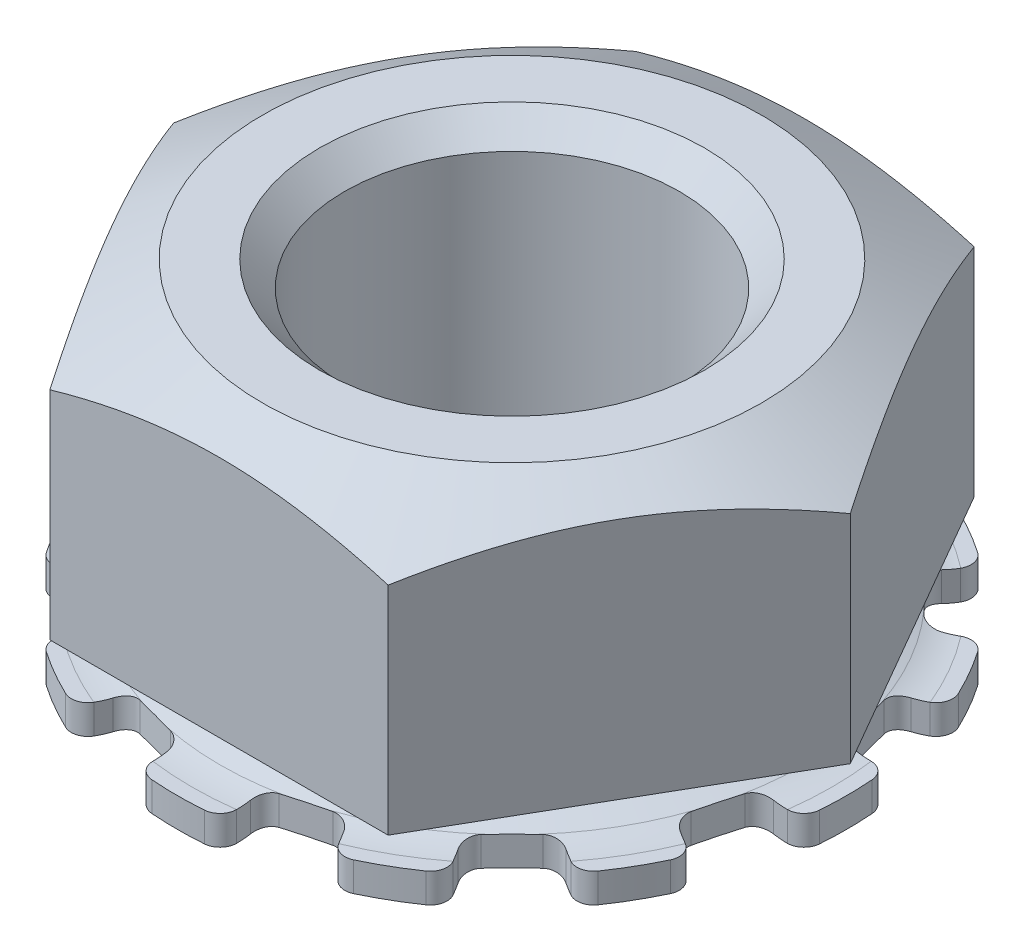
from build123d import *
from build123d.topology import SkipClean

# Parameters (mm, degrees)
EXTRUDE_2_REACH          = 8.499
FILLET_1_R               = 1
CUT_EXTRUDE_1_REACH      = 8.895
PATTERN_CIRCULAR_1_COUNT = 12
FILLET_2_R               = 0.2


with BuildPart() as part:
    # Sketch 1 → Revolve 1 (revolve)
    with BuildSketch(Plane.XY):
        Polygon((2, 3.6), (2, 0), (2.675, 0), (2.675, 0.35), (2.35, 0.35), (2.35, 0.7), (3.5, 0.7), (3.5, 3.6), (2.980384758, 3.9), (2.3, 3.9), align=None)
    revolve(axis=Axis((0, -97.506361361, 0), (0, 1, 0)))

    # Sketch 1_3 → Revolve 2 (revolve)
    with BuildSketch(Plane.XY):
        Polygon((2.35, 0.35), (2.675, 0.35), (3.65, 0), (4, 0), (4, 0.35), (3.65, 0.35), (2.675, 0.7), (2.35, 0.7), align=None)
    revolve(axis=Axis((0, -97.506361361, 0), (0, 1, 0)))

    # Extrude 2: up to this cone (the profile starts inside it)
    with SkipClean():  # the faces are left unmerged after this step: merging them gives an invalid solid
        extrude_2_end = Plane(origin=(0, 0.7, 0), z_dir=(0, -1, 0)).offset(-4.920724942) * Cone(1.732e-06, 38.871850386, 22.442672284, align=(Align.CENTER, Align.CENTER, Align.MIN), mode=Mode.PRIVATE)
        # Sketch 2 → Extrude 2 (add, up to the surface)
        with BuildSketch(Plane(origin=(0, 0.7, 0), x_dir=(1, 0, 0), z_dir=(0, 1, 0)), mode=Mode.PRIVATE) as extrude_2_sk1:
            with BuildLine():
                ThreePointArc((-3.03108888, -1.750000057), (-3.5, -4.1e-08), (-3.031088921, 1.749999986))
                Line((-3.031088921, 1.749999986), (-4.041451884, 0))
                Line((-4.041451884, 0), (-3.03108888, -1.750000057))
            make_face()
        extrude_2_tool1 = extrude(extrude_2_sk1.sketch, amount=EXTRUDE_2_REACH, mode=Mode.PRIVATE) & extrude_2_end
        add(extrude_2_tool1.solids().sort_by_distance((-3.617471, 0.7, 0))[0])
        # Sketch 2 → Extrude 2 (add, up to the surface)
        with BuildSketch(Plane(origin=(0, 0.7, 0), x_dir=(1, 0, 0), z_dir=(0, 1, 0)), mode=Mode.PRIVATE) as extrude_2_sk2:
            with BuildLine():
                Line((-2.020725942, -3.5), (0, -3.5))
                ThreePointArc((0, -3.5), (-1.749999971, -3.03108893), (-3.03108888, -1.750000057))
                Line((-3.03108888, -1.750000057), (-2.020725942, -3.5))
            make_face()
        extrude_2_tool2 = extrude(extrude_2_sk2.sketch, amount=EXTRUDE_2_REACH, mode=Mode.PRIVATE) & extrude_2_end
        add(extrude_2_tool2.solids().sort_by_distance((-1.808735, 0.7, 3.132821))[0])
        # Sketch 2 → Extrude 2 (add, up to the surface)
        with BuildSketch(Plane(origin=(0, 0.7, 0), x_dir=(1, 0, 0), z_dir=(0, 1, 0)), mode=Mode.PRIVATE) as extrude_2_sk3:
            with BuildLine():
                Line((2.020725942, -3.5), (3.03108887, -1.750000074))
                ThreePointArc((3.03108887, -1.750000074), (1.749999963, -3.031088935), (0, -3.5))
                Line((0, -3.5), (2.020725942, -3.5))
            make_face()
        extrude_2_tool3 = extrude(extrude_2_sk3.sketch, amount=EXTRUDE_2_REACH, mode=Mode.PRIVATE) & extrude_2_end
        add(extrude_2_tool3.solids().sort_by_distance((1.808735, 0.7, 3.132821))[0])
        # Sketch 2 → Extrude 2 (add, up to the surface)
        with BuildSketch(Plane(origin=(0, 0.7, 0), x_dir=(1, 0, 0), z_dir=(0, 1, 0)), mode=Mode.PRIVATE) as extrude_2_sk4:
            with BuildLine():
                Line((3.03108887, -1.750000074), (4.041451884, 0))
                Line((4.041451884, 0), (3.03108896, 1.749999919))
                ThreePointArc((3.03108896, 1.749999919), (3.380740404, 0.905866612), (3.5, 0))
                ThreePointArc((3.5, 0), (3.380740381, -0.905866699), (3.03108887, -1.750000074))
            make_face()
        extrude_2_tool4 = extrude(extrude_2_sk4.sketch, amount=EXTRUDE_2_REACH, mode=Mode.PRIVATE) & extrude_2_end
        add(extrude_2_tool4.solids().sort_by_distance((3.617471, 0.7, 0))[0])
        # Sketch 2 → Extrude 2 (add, up to the surface)
        with BuildSketch(Plane(origin=(0, 0.7, 0), x_dir=(1, 0, 0), z_dir=(0, 1, 0)), mode=Mode.PRIVATE) as extrude_2_sk5:
            with BuildLine():
                ThreePointArc((7e-09, 3.5), (1.750000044, 3.031088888), (3.03108896, 1.749999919))
                Line((3.03108896, 1.749999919), (2.020725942, 3.5))
                Line((2.020725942, 3.5), (7e-09, 3.5))
            make_face()
        extrude_2_tool5 = extrude(extrude_2_sk5.sketch, amount=EXTRUDE_2_REACH, mode=Mode.PRIVATE) & extrude_2_end
        add(extrude_2_tool5.solids().sort_by_distance((1.808735, 0.7, -3.132821))[0])
        # Sketch 2 → Extrude 2 (add, up to the surface)
        with BuildSketch(Plane(origin=(0, 0.7, 0), x_dir=(1, 0, 0), z_dir=(0, 1, 0)), mode=Mode.PRIVATE) as extrude_2_sk6:
            with BuildLine():
                ThreePointArc((-3.031088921, 1.749999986), (-1.750000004, 3.031088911), (7e-09, 3.5))
                Line((7e-09, 3.5), (-2.020725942, 3.5))
                Line((-2.020725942, 3.5), (-3.031088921, 1.749999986))
            make_face()
        extrude_2_tool6 = extrude(extrude_2_sk6.sketch, amount=EXTRUDE_2_REACH, mode=Mode.PRIVATE) & extrude_2_end
        add(extrude_2_tool6.solids().sort_by_distance((-1.808735, 0.7, -3.132821))[0])

    # Fillet 1
    fillet_1_edges = [part.edges().sort_by_distance(p)[0] for p in [
        (-3.65, 0, 0),
        (-3.65, 0.35, 0),
    ]]
    fillet(fillet_1_edges, radius=FILLET_1_R)

    # Sketch 3 → Cut-Extrude 1 (cut, up to next)
    with BuildSketch(Plane(origin=(0, 0, 0), x_dir=(1, 0, 0), z_dir=(0, 1, 0)), mode=Mode.PRIVATE) as cut_extrude_1_sk1:
        with BuildLine():
            Line((-0.5, 3.968626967), (-0.5, 3.468626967))
            Line((-0.5, 3.468626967), (-0.900650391, 3.361273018))
            Line((-0.900650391, 3.361273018), (-1.03527618, 3.863703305))
            ThreePointArc((-1.03527618, 3.863703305), (-0.769428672, 3.925299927), (-0.5, 3.968626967))
        make_face()
    cut_extrude_1_tool1 = extrude(cut_extrude_1_sk1.sketch, amount=CUT_EXTRUDE_1_REACH, mode=Mode.PRIVATE) & part.part
    # Sketch 3 → Cut-Extrude 1 (cut, up to next)
    with BuildSketch(Plane(origin=(0, 0, 0), x_dir=(1, 0, 0), z_dir=(0, 1, 0)), mode=Mode.PRIVATE) as cut_extrude_1_sk2:
        with BuildLine():
            Line((0.5, 3.468626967), (0.5, 3.968626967))
            ThreePointArc((0.5, 3.968626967), (0.769428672, 3.925299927), (1.03527618, 3.863703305))
            Line((1.03527618, 3.863703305), (0.900650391, 3.361273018))
            Line((0.900650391, 3.361273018), (0.5, 3.468626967))
        make_face()
    cut_extrude_1_tool2 = extrude(cut_extrude_1_sk2.sketch, amount=CUT_EXTRUDE_1_REACH, mode=Mode.PRIVATE) & part.part
    cut_extrude_1_1 = cut_extrude_1_tool1.solids().sort_by_distance((-0.738452, 0, -3.679985))[0]
    add(cut_extrude_1_1, mode=Mode.SUBTRACT)
    cut_extrude_1_2 = cut_extrude_1_tool2.solids().sort_by_distance((0.738452, 0, -3.679985))[0]
    add(cut_extrude_1_2, mode=Mode.SUBTRACT)
    cut_extrude_1 = cut_extrude_1_1 + cut_extrude_1_2  # Cut-Extrude 1 as one shape, for the pattern or mirror that repeats it

    # Pattern Circular 1: Cut-Extrude 1 ×12 about axis
    with SkipClean():  # the faces are left unmerged after this step: merging them gives an invalid solid
        pattern_circular_1_axis = Axis((0, 0, 0), (0, 1, 0))
        for i in range(1, PATTERN_CIRCULAR_1_COUNT):
            add(cut_extrude_1.rotate(pattern_circular_1_axis, i * 360 / PATTERN_CIRCULAR_1_COUNT), mode=Mode.SUBTRACT)

    # Fillet 2
    fillet_2_edges = [part.edges().sort_by_distance(p)[0] for p in [
        (-0.5, 0.227437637, -3.468626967),
        (-0.5, 0.175, -3.968626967),
        (0.5, 0.227437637, -3.468626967),
        (0.5, 0.175, -3.968626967),
        (2.167326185, 0.227437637, 2.753919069),
        (2.753919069, 0.227437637, 2.167326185),
        (2.417326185, 0.175, 3.186931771),
        (3.186931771, 0.175, 2.417326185),
        (0.5, 0.227437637, 3.468626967),
        (1.301300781, 0.227437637, 3.253919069),
        (0.5, 0.175, 3.968626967),
        (1.551300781, 0.175, 3.686931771),
        (3.468626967, 0.227437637, -0.5),
        (3.253919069, 0.227437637, -1.301300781),
        (3.968626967, 0.175, -0.5),
        (3.686931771, 0.175, -1.551300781),
        (3.253919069, 0.227437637, 1.301300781),
        (3.468626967, 0.227437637, 0.5),
        (3.686931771, 0.175, 1.551300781),
        (3.968626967, 0.175, 0.5),
        (-3.468626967, 0.227437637, 0.5),
        (-3.253919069, 0.227437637, 1.301300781),
        (-3.968626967, 0.175, 0.5),
        (-3.686931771, 0.175, 1.551300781),
        (-3.253919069, 0.227437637, -1.301300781),
        (-3.468626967, 0.227437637, -0.5),
        (-3.686931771, 0.175, -1.551300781),
        (-3.968626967, 0.175, -0.5),
        (-1.301300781, 0.227437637, -3.253919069),
        (-1.551300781, 0.175, -3.686931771),
        (-1.301300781, 0.227437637, 3.253919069),
        (-0.5, 0.227437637, 3.468626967),
        (-1.551300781, 0.175, 3.686931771),
        (-0.5, 0.175, 3.968626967),
        (-2.753919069, 0.227437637, 2.167326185),
        (-2.167326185, 0.227437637, 2.753919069),
        (-3.186931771, 0.175, 2.417326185),
        (-2.417326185, 0.175, 3.186931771),
        (2.753919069, 0.227437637, -2.167326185),
        (2.167326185, 0.227437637, -2.753919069),
        (3.186931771, 0.175, -2.417326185),
        (2.417326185, 0.175, -3.186931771),
        (1.301300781, 0.227437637, -3.253919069),
        (1.551300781, 0.175, -3.686931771),
        (-2.167326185, 0.227437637, -2.753919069),
        (-2.753919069, 0.227437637, -2.167326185),
        (-2.417326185, 0.175, -3.186931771),
        (-3.186931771, 0.175, -2.417326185),
    ]]
    fillet(fillet_2_edges, radius=FILLET_2_R)


solid = part.part
